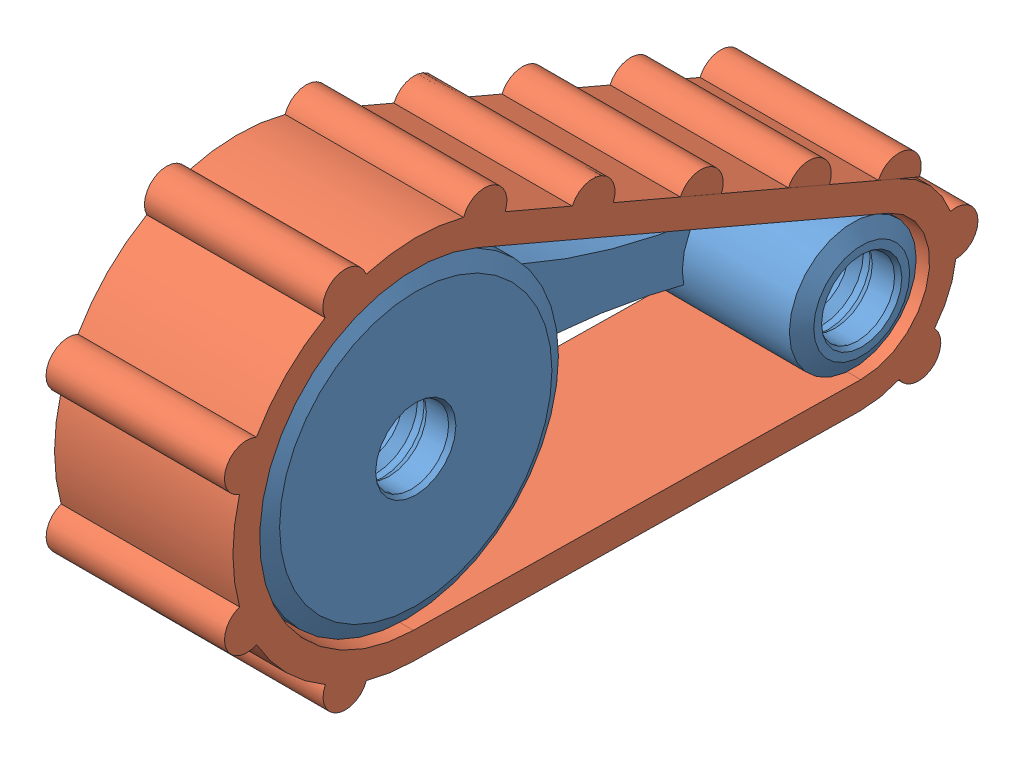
SolidWorks assembly Assem6.sldasm, configuration Default (file format 4400). Lengths in mm.
Overall size (20 43.1 84.49).
2 component instances, 2 part files, 3 mates.
Components (placement in the parent):
- tread4-1: tread4.SLDPRT [Default] at (-58.1501 10.7732 -18.8192) size (20 34.73 74.11)
- tread with tread 5 belt2.dennis-1: tread with tread 5 belt2.dennis.SLDPRT [Default] at (-58.1501 10.7732 -18.8192) size (20 43.1 84.49)
Mates (geometry in assembly coordinates):
- Coincident1: coincident: plane of tread4-1 through (-38.1501 21.3923 31.1808) normal (1 0 0); plane of tread with tread 5 belt2.dennis-1 through (-38.1501 20.3914 -61.2818) normal (1 0 0)
- Concentric1: concentric: cylinder of tread4-1 through (-38.1501 21.3923 31.1808) axis (-1 0 0) radius 17; cylinder of tread with tread 5 belt2.dennis-1 through (-38.1501 21.3923 31.1808) axis (-1 0 0) radius 17.5
- Concentric2: concentric aligned: cylinder of tread4-1 through (-38.1501 10.7732 -18.8192) axis (-1 0 0) radius 7.1142; cylinder of tread with tread 5 belt2.dennis-1 through (-38.1501 10.7732 -18.8192) axis (-1 0 0) radius 7.6142
